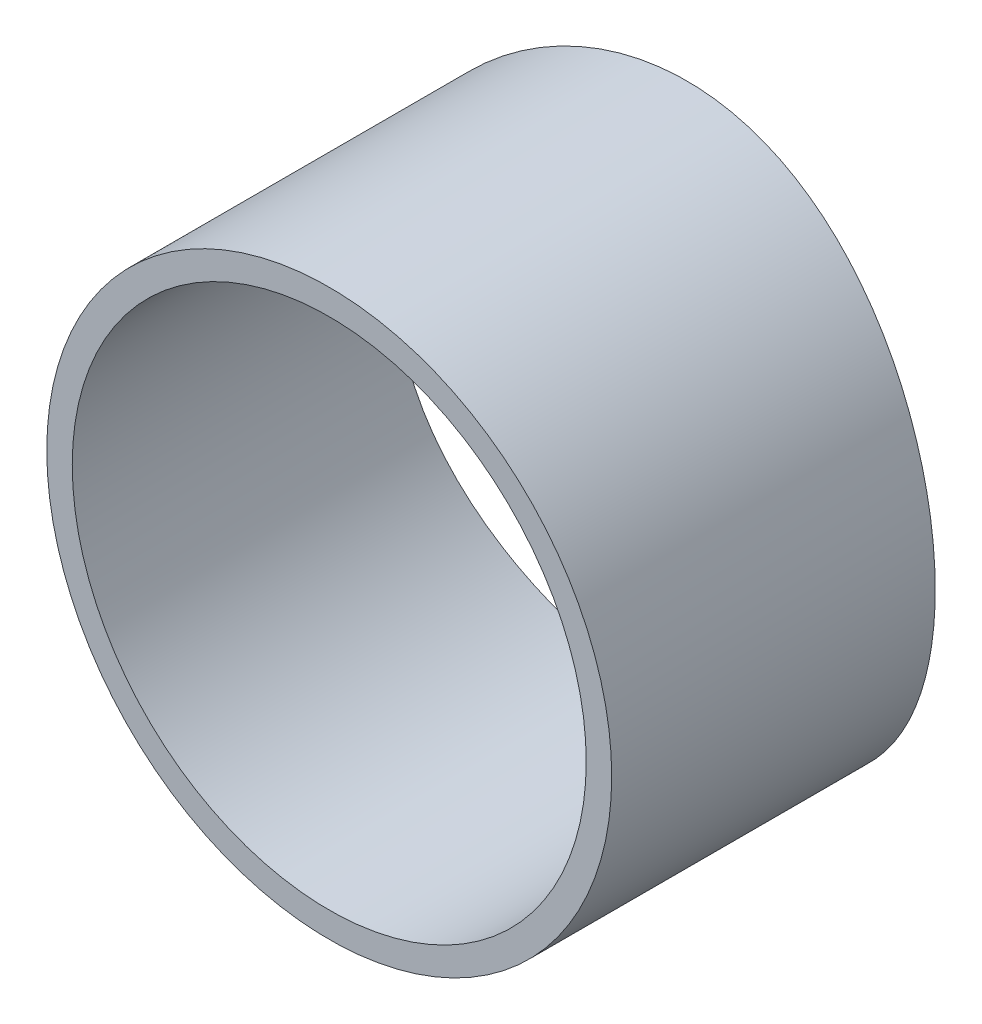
from build123d import *

# Parameters (mm, degrees)
ESQUISSE1_R             = 69.85
ESQUISSE1_R_2           = 63.55
EXTRU_MINCE1_DEPTH      = 670
ESQUISSE2_R             = 295
ENL_V_MAT_EXTRU_3_DEPTH = 540


with BuildPart() as part:
    # Esquisse1 → Extru.-Mince1 (new body)
    with BuildSketch(Plane.XY):
        with Locations((400, 0)):
            Circle(ESQUISSE1_R)
        with Locations((400, 0)):
            Circle(ESQUISSE1_R_2, mode=Mode.SUBTRACT)
    extrude(amount=-EXTRU_MINCE1_DEPTH)

    # Esquisse2 → Enl_v. mat.-Extru.3 (cut)
    with BuildSketch(Plane(origin=(0, 0, 0), x_dir=(0, 0, -1), z_dir=(1, 0, 0))):
        with Locations((375, 0)):
            Circle(ESQUISSE2_R)
    extrude(amount=ENL_V_MAT_EXTRU_3_DEPTH, mode=Mode.SUBTRACT)


with BuildPart() as enl_v_mat_extru_3_kept_piece:
    # of the separate pieces the step leaves, the one the design keeps (enl_v_mat_extru_3_pieces_kept)
    add(part.part.solids().sort_by_distance((469.85, 0, 0))[0])


solid = enl_v_mat_extru_3_kept_piece.part
